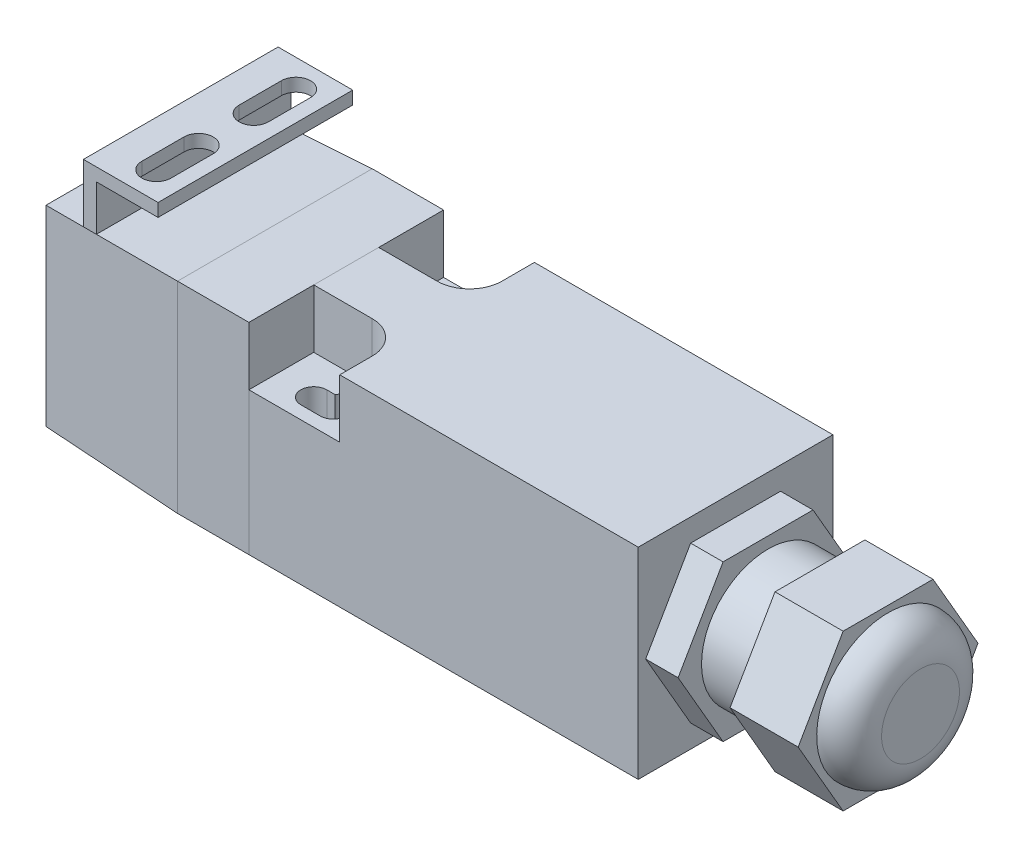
from build123d import *

# Parameters (mm, degrees)
ESQUISSE1_W                = 60
ESQUISSE1_H                = 31
EXTRUSION1_DEPTH           = 15
ENL_V_MAT_EXTRU_1_DEPTH    = 9
ENL_V_MAT_EXTRU_2_DEPTH    = 70.180922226
ESQUISSE4_W                = 30
ESQUISSE4_H                = 31
EXTRUSION2_DEPTH           = 11
ESQUISSE5_W                = 30
ESQUISSE5_H                = 31
EXTRUSION3_DEPTH           = 21
EXTRUSION3_TAPER           = 2
ESQUISSE6_W                = 5
ESQUISSE6_H                = 15
ENL_V_MAT_EXTRU_3_DEPTH    = 5
ESQUISSE7_W                = 2
ESQUISSE7_H                = 13
EXTRUSION4_DEPTH           = 5
ESQUISSE8_W                = 2
ESQUISSE8_H                = 30
EXTRUSION5_DEPTH           = 9
ESQUISSE9_W                = 30
ESQUISSE9_H                = 2
EXTRUSION6_DEPTH           = 9.5
LUMIERE1_DEPTH             = 2
R_P_TITION_LIN_AIRE1_COUNT = 2
R_P_TITION_LIN_AIRE1_PITCH = 15
EXTRUSION7_DEPTH           = 5
ESQUISSE11_R               = 10.25
EXTRUSION8_DEPTH           = 8
EXTRUSION9_DEPTH           = 10.5


with BuildPart() as part:
    # Esquisse1 → Extrusion1 (new, symmetric)
    with BuildSketch(Plane.XY):
        with Locations((30, 0)):
            Rectangle(ESQUISSE1_W, ESQUISSE1_H)
    extrude(amount=EXTRUSION1_DEPTH, both=True)

    # Esquisse2 → Enl_v. mat.-Extru.1 (cut)
    with BuildSketch(Plane(origin=(0, 15.5, 0), x_dir=(-1, 0, 0), z_dir=(0, 1, 0))):
        with BuildLine():
            Line((0, -15), (-14, -15))
            Line((-14, -15), (-14, -10))
            ThreePointArc((-14, -10), (-12.535533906, -6.464466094), (-9, -5))
            Line((-9, -5), (0, -5))
            Line((0, -5), (0, -15))
        make_face()
        with BuildLine():
            Line((0, 15), (-14, 15))
            Line((-14, 15), (-14, 10))
            ThreePointArc((-14, 10), (-12.535533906, 6.464466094), (-9, 5))
            Line((-9, 5), (0, 5))
            Line((0, 5), (0, 15))
        make_face()
    extrude(amount=-ENL_V_MAT_EXTRU_1_DEPTH, mode=Mode.SUBTRACT)

    # Esquisse3 → Enl_v. mat.-Extru.2 (cut, through all)
    with BuildSketch(Plane.XZ.offset(15.5)):
        with BuildLine():
            Line((6, 13), (9, 13))
            ThreePointArc((9, 13), (10.414213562, 12.414213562), (11, 11))
            Line((11, 11), (11, 10))
            ThreePointArc((11, 10), (9.51763809, 8.068148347), (7.267949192, 9))
            Line((7.267949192, 9), (6, 9))
            ThreePointArc((6, 9), (4, 11), (6, 13))
        make_face()
        with BuildLine():
            Line((6, -9), (7.267949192, -9))
            ThreePointArc((7.267949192, -9), (9.51763809, -8.068148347), (11, -10))
            Line((11, -10), (11, -11))
            ThreePointArc((11, -11), (10.414213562, -12.414213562), (9, -13))
            Line((9, -13), (6, -13))
            ThreePointArc((6, -13), (4, -11), (6, -9))
        make_face()
    extrude(amount=-ENL_V_MAT_EXTRU_2_DEPTH, mode=Mode.SUBTRACT)

    # Esquisse10 → Extrusion7 (add)
    with BuildSketch(Plane(origin=(60, 0, 0), x_dir=(0, 0, -1), z_dir=(1, 0, 0))):
        Polygon((13.856406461, 0), (6.92820323, 12), (-6.92820323, 12), (-13.856406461, 0), (-6.92820323, -12), (6.92820323, -12), align=None)
    extrude(amount=EXTRUSION7_DEPTH)

    # Esquisse11 → Extrusion8 (add)
    with BuildSketch(Plane(origin=(65, 0, 0), x_dir=(0, 0, -1), z_dir=(1, 0, 0))):
        with Locations(Location((0, 0, 0), (0, 0, 180))):
            Circle(ESQUISSE11_R)
    extrude(amount=EXTRUSION8_DEPTH)

    # Esquisse12 → Extrusion9 (add)
    with BuildSketch(Plane(origin=(73, 0, 0), x_dir=(0, 0, -1), z_dir=(1, 0, 0))):
        Polygon((6.92820323, -12), (13.856406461, 0), (6.92820323, 12), (-6.92820323, 12), (-13.856406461, 0), (-6.92820323, -12), align=None)
    extrude(amount=EXTRUSION9_DEPTH)

    # Esquisse13 → R_volution1 (revolve)
    with BuildSketch(Plane.XY, mode=Mode.PRIVATE) as r_volution1_sk:
        with BuildLine():
            Line((83.5, 11), (83.5, 0))
            Line((83.5, 0), (88.5, 0))
            Line((88.5, 0), (88.5, 6))
            ThreePointArc((88.5, 6), (87.035533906, 9.535533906), (83.5, 11))
        make_face()
    revolve(r_volution1_sk.sketch.rotate(Axis((83.5, 0, 0), (1, 0, 0)), 180), axis=Axis((83.5, 0, 0), (1, 0, 0)))


with BuildPart() as body_2:
    # Esquisse4 → Extrusion2 (new body)
    with BuildSketch(Plane.ZY):
        Rectangle(ESQUISSE4_W, ESQUISSE4_H)
    extrude(amount=EXTRUSION2_DEPTH)

    # Esquisse5 → Extrusion3 (add)
    with BuildSketch(Plane.ZY.offset(11)):
        Rectangle(ESQUISSE5_W, ESQUISSE5_H)
    extrude(amount=EXTRUSION3_DEPTH, taper=EXTRUSION3_TAPER)

    # Esquisse6 → Enl_v. mat.-Extru.3 (cut)
    with BuildSketch(Plane(origin=(0, 15.5, 0), x_dir=(-1, 0, 0), z_dir=(0, 1, 0))):
        with Locations((24.5, 0)):
            Rectangle(ESQUISSE6_W, ESQUISSE6_H)
    extrude(amount=-ENL_V_MAT_EXTRU_3_DEPTH, mode=Mode.SUBTRACT)


with BuildPart() as body_3:
    # Esquisse7 → Extrusion4 (new body)
    with BuildSketch(Plane(origin=(0, 15.5, 0), x_dir=(-1, 0, 0), z_dir=(0, 1, 0))):
        with Locations((24.5, 0)):
            Rectangle(ESQUISSE7_W, ESQUISSE7_H)
    extrude(amount=-EXTRUSION4_DEPTH)

    # Esquisse8 → Extrusion5 (add)
    with BuildSketch(Plane(origin=(0, 15.5, 0), x_dir=(-1, 0, 0), z_dir=(0, 1, 0))):
        with Locations((24.5, 0)):
            Rectangle(ESQUISSE8_W, ESQUISSE8_H)
    extrude(amount=EXTRUSION5_DEPTH)

    # Esquisse9 → Extrusion6 (add)
    with BuildSketch(Plane(origin=(-23.5, 0, 0), x_dir=(0, 0, -1), z_dir=(1, 0, 0))):
        with Locations((0, 23.5)):
            Rectangle(ESQUISSE9_W, ESQUISSE9_H)
    extrude(amount=EXTRUSION6_DEPTH)

    # Sketch2 → lumiere1 (cut)
    with BuildSketch(Plane(origin=(80.786894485, 24.5, -96.15938755), x_dir=(-1, 0, 0), z_dir=(0, 1, 0))):
        with BuildLine():
            Line((97.036894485, 91.90938755), (97.036894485, 85.40938755))
            ThreePointArc((97.036894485, 85.40938755), (99.286894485, 83.15938755), (101.536894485, 85.40938755))
            Line((101.536894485, 85.40938755), (101.536894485, 91.90938755))
            ThreePointArc((101.536894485, 91.90938755), (99.286894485, 94.15938755), (97.036894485, 91.90938755))
        make_face()
    lumiere1 = extrude(amount=-LUMIERE1_DEPTH, mode=Mode.SUBTRACT)

    # R_p_tition lin_aire1: lumiere1 ×2
    with Locations(*[(0, 0, i * R_P_TITION_LIN_AIRE1_PITCH) for i in range(1, R_P_TITION_LIN_AIRE1_COUNT)]):
        add(lumiere1, mode=Mode.SUBTRACT)


solid = Compound([part.part, body_2.part, body_3.part])
